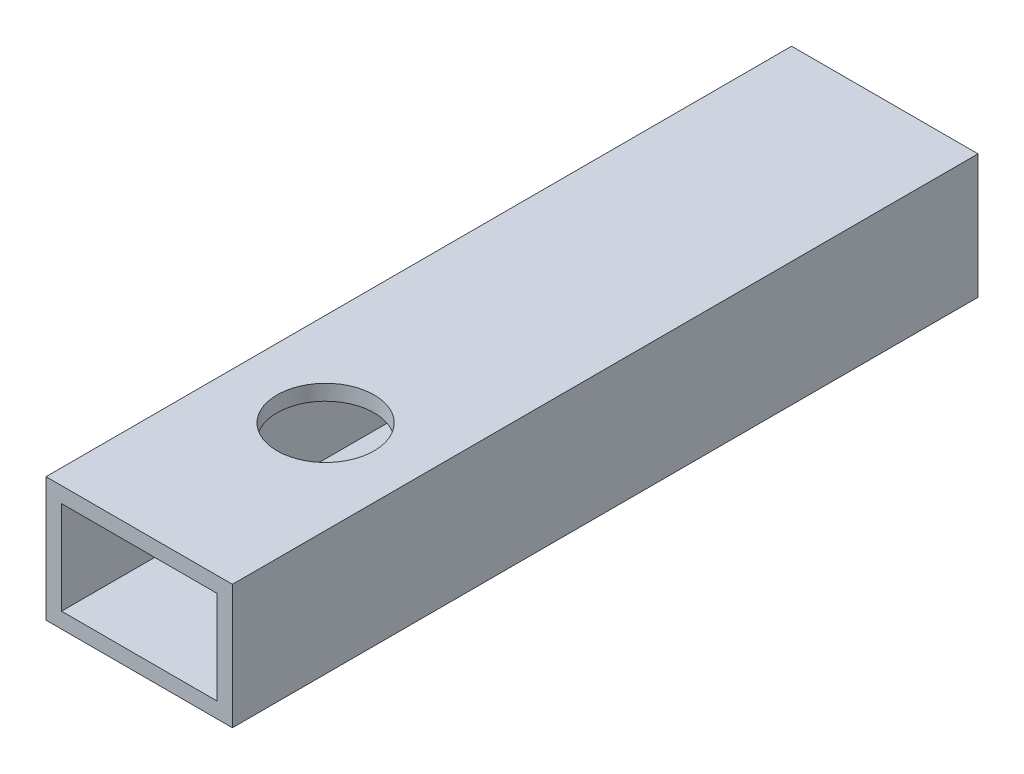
ISO-10303-21;
HEADER;
FILE_DESCRIPTION(('STEP AP214'),'2;1');
FILE_NAME('part.step','',(''),(''),'','','');
FILE_SCHEMA(('AUTOMOTIVE_DESIGN { 1 0 10303 214 1 1 1 1 }'));
ENDSEC;
DATA;
#1=APPLICATION_CONTEXT('core data for automotive mechanical design processes');
#2=APPLICATION_PROTOCOL_DEFINITION('international standard','automotive_design',2000,#1);
#3=PRODUCT_CONTEXT('',#1,'mechanical');
#4=PRODUCT('Part','Part','',(#3));
#5=PRODUCT_RELATED_PRODUCT_CATEGORY('part','',(#4));
#6=PRODUCT_DEFINITION_FORMATION('','',#4);
#7=PRODUCT_DEFINITION_CONTEXT('part definition',#1,'design');
#8=PRODUCT_DEFINITION('design','',#6,#7);
#9=PRODUCT_DEFINITION_SHAPE('','',#8);
#10=(LENGTH_UNIT() NAMED_UNIT(*) SI_UNIT(.MILLI.,.METRE.));
#11=(NAMED_UNIT(*) PLANE_ANGLE_UNIT() SI_UNIT($,.RADIAN.));
#12=(NAMED_UNIT(*) SI_UNIT($,.STERADIAN.) SOLID_ANGLE_UNIT());
#13=UNCERTAINTY_MEASURE_WITH_UNIT(LENGTH_MEASURE(1.E-05),#10,'distance_accuracy_value','');
#14=(GEOMETRIC_REPRESENTATION_CONTEXT(3) GLOBAL_UNCERTAINTY_ASSIGNED_CONTEXT((#13)) GLOBAL_UNIT_ASSIGNED_CONTEXT((#10,
#11,#12)) REPRESENTATION_CONTEXT('',''));
#15=CARTESIAN_POINT('',(0.,0.,0.));
#16=DIRECTION('',(0.,0.,1.));
#17=DIRECTION('',(1.,0.,0.));
#18=AXIS2_PLACEMENT_3D('',#15,#16,#17);
#19=CARTESIAN_POINT('',(-38.1,-25.4,-304.8));
#20=DIRECTION('',(-1.,0.,0.));
#21=DIRECTION('',(0.,0.,1.));
#22=AXIS2_PLACEMENT_3D('',#19,#20,#21);
#23=PLANE('',#22);
#24=DIRECTION('',(0.,-1.,0.));
#25=VECTOR('',#24,1.);
#26=CARTESIAN_POINT('',(-38.1,-25.4,0.));
#27=LINE('',#26,#25);
#28=CARTESIAN_POINT('',(-38.1,25.4,0.));
#29=VERTEX_POINT('',#28);
#30=CARTESIAN_POINT('',(-38.1,-25.4,0.));
#31=VERTEX_POINT('',#30);
#32=EDGE_CURVE('E130',#29,#31,#27,.T.);
#33=ORIENTED_EDGE('',*,*,#32,.F.);
#34=DIRECTION('',(0.,0.,1.));
#35=VECTOR('',#34,1.);
#36=CARTESIAN_POINT('',(-38.1,25.4,-304.8));
#37=LINE('',#36,#35);
#38=CARTESIAN_POINT('',(-38.1,25.4,-304.8));
#39=VERTEX_POINT('',#38);
#40=EDGE_CURVE('E11',#39,#29,#37,.T.);
#41=ORIENTED_EDGE('',*,*,#40,.F.);
#42=DIRECTION('',(0.,-1.,0.));
#43=VECTOR('',#42,1.);
#44=CARTESIAN_POINT('',(-38.1,-25.4,-304.8));
#45=LINE('',#44,#43);
#46=CARTESIAN_POINT('',(-38.1,-25.4,-304.8));
#47=VERTEX_POINT('',#46);
#48=EDGE_CURVE('E144',#39,#47,#45,.T.);
#49=ORIENTED_EDGE('',*,*,#48,.T.);
#50=DIRECTION('',(0.,0.,1.));
#51=VECTOR('',#50,1.);
#52=CARTESIAN_POINT('',(-38.1,-25.4,-304.8));
#53=LINE('',#52,#51);
#54=EDGE_CURVE('E155',#47,#31,#53,.T.);
#55=ORIENTED_EDGE('',*,*,#54,.T.);
#56=EDGE_LOOP('',(#33,#41,#49,#55));
#57=FACE_BOUND('',#56,.T.);
#58=ADVANCED_FACE('F31',(#57),#23,.T.);
#59=CARTESIAN_POINT('',(-38.1,25.4,-304.8));
#60=DIRECTION('',(0.,1.,0.));
#61=DIRECTION('',(0.,0.,1.));
#62=AXIS2_PLACEMENT_3D('',#59,#60,#61);
#63=PLANE('',#62);
#64=CARTESIAN_POINT('',(0.,25.4,-76.2));
#65=DIRECTION('',(0.,1.,0.));
#66=DIRECTION('',(0.,0.,1.));
#67=AXIS2_PLACEMENT_3D('',#64,#65,#66);
#68=CIRCLE('',#67,19.8374);
#69=CARTESIAN_POINT('',(0.,25.4,-56.3626));
#70=VERTEX_POINT('',#69);
#71=EDGE_CURVE('E240',#70,#70,#68,.T.);
#72=ORIENTED_EDGE('',*,*,#71,.F.);
#73=EDGE_LOOP('',(#72));
#74=FACE_BOUND('',#73,.T.);
#75=DIRECTION('',(-1.,0.,0.));
#76=VECTOR('',#75,1.);
#77=CARTESIAN_POINT('',(-38.1,25.4,0.));
#78=LINE('',#77,#76);
#79=CARTESIAN_POINT('',(38.1,25.4,0.));
#80=VERTEX_POINT('',#79);
#81=EDGE_CURVE('E141',#80,#29,#78,.T.);
#82=ORIENTED_EDGE('',*,*,#81,.F.);
#83=DIRECTION('',(0.,0.,1.));
#84=VECTOR('',#83,1.);
#85=CARTESIAN_POINT('',(38.1,25.4,-304.8));
#86=LINE('',#85,#84);
#87=CARTESIAN_POINT('',(38.1,25.4,-304.8));
#88=VERTEX_POINT('',#87);
#89=EDGE_CURVE('E39',#88,#80,#86,.T.);
#90=ORIENTED_EDGE('',*,*,#89,.F.);
#91=DIRECTION('',(-1.,0.,0.));
#92=VECTOR('',#91,1.);
#93=CARTESIAN_POINT('',(-38.1,25.4,-304.8));
#94=LINE('',#93,#92);
#95=EDGE_CURVE('E153',#88,#39,#94,.T.);
#96=ORIENTED_EDGE('',*,*,#95,.T.);
#97=ORIENTED_EDGE('',*,*,#40,.T.);
#98=EDGE_LOOP('',(#82,#90,#96,#97));
#99=FACE_BOUND('',#98,.T.);
#100=ADVANCED_FACE('F169',(#74,#99),#63,.T.);
#101=CARTESIAN_POINT('',(38.1,-25.4,-304.8));
#102=DIRECTION('',(1.,0.,0.));
#103=DIRECTION('',(0.,0.,-1.));
#104=AXIS2_PLACEMENT_3D('',#101,#102,#103);
#105=PLANE('',#104);
#106=DIRECTION('',(0.,1.,0.));
#107=VECTOR('',#106,1.);
#108=CARTESIAN_POINT('',(38.1,-25.4,0.));
#109=LINE('',#108,#107);
#110=CARTESIAN_POINT('',(38.1,-25.4,0.));
#111=VERTEX_POINT('',#110);
#112=EDGE_CURVE('E138',#111,#80,#109,.T.);
#113=ORIENTED_EDGE('',*,*,#112,.F.);
#114=DIRECTION('',(0.,0.,1.));
#115=VECTOR('',#114,1.);
#116=CARTESIAN_POINT('',(38.1,-25.4,-304.8));
#117=LINE('',#116,#115);
#118=CARTESIAN_POINT('',(38.1,-25.4,-304.8));
#119=VERTEX_POINT('',#118);
#120=EDGE_CURVE('E158',#119,#111,#117,.T.);
#121=ORIENTED_EDGE('',*,*,#120,.F.);
#122=DIRECTION('',(0.,1.,0.));
#123=VECTOR('',#122,1.);
#124=CARTESIAN_POINT('',(38.1,-25.4,-304.8));
#125=LINE('',#124,#123);
#126=EDGE_CURVE('E150',#119,#88,#125,.T.);
#127=ORIENTED_EDGE('',*,*,#126,.T.);
#128=ORIENTED_EDGE('',*,*,#89,.T.);
#129=EDGE_LOOP('',(#113,#121,#127,#128));
#130=FACE_BOUND('',#129,.T.);
#131=ADVANCED_FACE('F175',(#130),#105,.T.);
#132=CARTESIAN_POINT('',(-38.1,-25.4,-304.8));
#133=DIRECTION('',(0.,-1.,0.));
#134=DIRECTION('',(0.,0.,-1.));
#135=AXIS2_PLACEMENT_3D('',#132,#133,#134);
#136=PLANE('',#135);
#137=DIRECTION('',(1.,0.,0.));
#138=VECTOR('',#137,1.);
#139=CARTESIAN_POINT('',(-38.1,-25.4,0.));
#140=LINE('',#139,#138);
#141=EDGE_CURVE('E135',#31,#111,#140,.T.);
#142=ORIENTED_EDGE('',*,*,#141,.F.);
#143=ORIENTED_EDGE('',*,*,#54,.F.);
#144=DIRECTION('',(1.,0.,0.));
#145=VECTOR('',#144,1.);
#146=CARTESIAN_POINT('',(-38.1,-25.4,-304.8));
#147=LINE('',#146,#145);
#148=EDGE_CURVE('E147',#47,#119,#147,.T.);
#149=ORIENTED_EDGE('',*,*,#148,.T.);
#150=ORIENTED_EDGE('',*,*,#120,.T.);
#151=EDGE_LOOP('',(#142,#143,#149,#150));
#152=FACE_BOUND('',#151,.T.);
#153=ADVANCED_FACE('F165',(#152),#136,.T.);
#154=CARTESIAN_POINT('',(-38.1,25.4,-304.8));
#155=DIRECTION('',(0.,0.,-1.));
#156=DIRECTION('',(-1.,0.,0.));
#157=AXIS2_PLACEMENT_3D('',#154,#155,#156);
#158=PLANE('',#157);
#159=DIRECTION('',(1.,0.,0.));
#160=VECTOR('',#159,1.);
#161=CARTESIAN_POINT('',(-31.75,-19.05,-304.8));
#162=LINE('',#161,#160);
#163=CARTESIAN_POINT('',(-31.75,-19.05,-304.8));
#164=VERTEX_POINT('',#163);
#165=CARTESIAN_POINT('',(31.75,-19.05,-304.8));
#166=VERTEX_POINT('',#165);
#167=EDGE_CURVE('E116',#164,#166,#162,.T.);
#168=ORIENTED_EDGE('',*,*,#167,.T.);
#169=DIRECTION('',(0.,1.,0.));
#170=VECTOR('',#169,1.);
#171=CARTESIAN_POINT('',(31.75,-19.05,-304.8));
#172=LINE('',#171,#170);
#173=CARTESIAN_POINT('',(31.75,19.05,-304.8));
#174=VERTEX_POINT('',#173);
#175=EDGE_CURVE('E122',#166,#174,#172,.T.);
#176=ORIENTED_EDGE('',*,*,#175,.T.);
#177=DIRECTION('',(-1.,0.,0.));
#178=VECTOR('',#177,1.);
#179=CARTESIAN_POINT('',(-31.75,19.05,-304.8));
#180=LINE('',#179,#178);
#181=CARTESIAN_POINT('',(-31.75,19.05,-304.8));
#182=VERTEX_POINT('',#181);
#183=EDGE_CURVE('E47',#174,#182,#180,.T.);
#184=ORIENTED_EDGE('',*,*,#183,.T.);
#185=DIRECTION('',(0.,-1.,0.));
#186=VECTOR('',#185,1.);
#187=CARTESIAN_POINT('',(-31.75,-19.05,-304.8));
#188=LINE('',#187,#186);
#189=EDGE_CURVE('E125',#182,#164,#188,.T.);
#190=ORIENTED_EDGE('',*,*,#189,.T.);
#191=EDGE_LOOP('',(#168,#176,#184,#190));
#192=FACE_BOUND('',#191,.T.);
#193=ORIENTED_EDGE('',*,*,#48,.F.);
#194=ORIENTED_EDGE('',*,*,#95,.F.);
#195=ORIENTED_EDGE('',*,*,#126,.F.);
#196=ORIENTED_EDGE('',*,*,#148,.F.);
#197=EDGE_LOOP('',(#193,#194,#195,#196));
#198=FACE_BOUND('',#197,.T.);
#199=ADVANCED_FACE('F172',(#192,#198),#158,.T.);
#200=CARTESIAN_POINT('',(-38.1,25.4,0.));
#201=DIRECTION('',(0.,0.,-1.));
#202=DIRECTION('',(-1.,0.,0.));
#203=AXIS2_PLACEMENT_3D('',#200,#201,#202);
#204=PLANE('',#203);
#205=DIRECTION('',(0.,1.,0.));
#206=VECTOR('',#205,1.);
#207=CARTESIAN_POINT('',(31.75,-19.05,0.));
#208=LINE('',#207,#206);
#209=CARTESIAN_POINT('',(31.75,-19.05,0.));
#210=VERTEX_POINT('',#209);
#211=CARTESIAN_POINT('',(31.75,19.05,0.));
#212=VERTEX_POINT('',#211);
#213=EDGE_CURVE('E107',#210,#212,#208,.T.);
#214=ORIENTED_EDGE('',*,*,#213,.F.);
#215=DIRECTION('',(1.,0.,0.));
#216=VECTOR('',#215,1.);
#217=CARTESIAN_POINT('',(-31.75,-19.05,0.));
#218=LINE('',#217,#216);
#219=CARTESIAN_POINT('',(-31.75,-19.05,0.));
#220=VERTEX_POINT('',#219);
#221=EDGE_CURVE('E55',#220,#210,#218,.T.);
#222=ORIENTED_EDGE('',*,*,#221,.F.);
#223=DIRECTION('',(0.,-1.,0.));
#224=VECTOR('',#223,1.);
#225=CARTESIAN_POINT('',(-31.75,-19.05,0.));
#226=LINE('',#225,#224);
#227=CARTESIAN_POINT('',(-31.75,19.05,0.));
#228=VERTEX_POINT('',#227);
#229=EDGE_CURVE('E114',#228,#220,#226,.T.);
#230=ORIENTED_EDGE('',*,*,#229,.F.);
#231=DIRECTION('',(-1.,0.,0.));
#232=VECTOR('',#231,1.);
#233=CARTESIAN_POINT('',(-31.75,19.05,0.));
#234=LINE('',#233,#232);
#235=EDGE_CURVE('E98',#212,#228,#234,.T.);
#236=ORIENTED_EDGE('',*,*,#235,.F.);
#237=EDGE_LOOP('',(#214,#222,#230,#236));
#238=FACE_BOUND('',#237,.T.);
#239=ORIENTED_EDGE('',*,*,#32,.T.);
#240=ORIENTED_EDGE('',*,*,#141,.T.);
#241=ORIENTED_EDGE('',*,*,#112,.T.);
#242=ORIENTED_EDGE('',*,*,#81,.T.);
#243=EDGE_LOOP('',(#239,#240,#241,#242));
#244=FACE_BOUND('',#243,.T.);
#245=ADVANCED_FACE('F111',(#238,#244),#204,.F.);
#246=CARTESIAN_POINT('',(-31.75,-19.05,-304.8));
#247=DIRECTION('',(0.,-1.,0.));
#248=DIRECTION('',(0.,0.,-1.));
#249=AXIS2_PLACEMENT_3D('',#246,#247,#248);
#250=PLANE('',#249);
#251=ORIENTED_EDGE('',*,*,#221,.T.);
#252=DIRECTION('',(0.,0.,1.));
#253=VECTOR('',#252,1.);
#254=CARTESIAN_POINT('',(31.75,-19.05,-304.8));
#255=LINE('',#254,#253);
#256=EDGE_CURVE('E104',#166,#210,#255,.T.);
#257=ORIENTED_EDGE('',*,*,#256,.F.);
#258=ORIENTED_EDGE('',*,*,#167,.F.);
#259=DIRECTION('',(0.,0.,1.));
#260=VECTOR('',#259,1.);
#261=CARTESIAN_POINT('',(-31.75,-19.05,-304.8));
#262=LINE('',#261,#260);
#263=EDGE_CURVE('E128',#164,#220,#262,.T.);
#264=ORIENTED_EDGE('',*,*,#263,.T.);
#265=EDGE_LOOP('',(#251,#257,#258,#264));
#266=FACE_BOUND('',#265,.T.);
#267=ADVANCED_FACE('F227',(#266),#250,.F.);
#268=CARTESIAN_POINT('',(-31.75,-19.05,-304.8));
#269=DIRECTION('',(-1.,0.,0.));
#270=DIRECTION('',(0.,0.,1.));
#271=AXIS2_PLACEMENT_3D('',#268,#269,#270);
#272=PLANE('',#271);
#273=ORIENTED_EDGE('',*,*,#229,.T.);
#274=ORIENTED_EDGE('',*,*,#263,.F.);
#275=ORIENTED_EDGE('',*,*,#189,.F.);
#276=DIRECTION('',(0.,0.,1.));
#277=VECTOR('',#276,1.);
#278=CARTESIAN_POINT('',(-31.75,19.05,-304.8));
#279=LINE('',#278,#277);
#280=EDGE_CURVE('E103',#182,#228,#279,.T.);
#281=ORIENTED_EDGE('',*,*,#280,.T.);
#282=EDGE_LOOP('',(#273,#274,#275,#281));
#283=FACE_BOUND('',#282,.T.);
#284=ADVANCED_FACE('F206',(#283),#272,.F.);
#285=CARTESIAN_POINT('',(-31.75,19.05,-304.8));
#286=DIRECTION('',(0.,1.,0.));
#287=DIRECTION('',(0.,0.,1.));
#288=AXIS2_PLACEMENT_3D('',#285,#286,#287);
#289=PLANE('',#288);
#290=CARTESIAN_POINT('',(0.,19.05,-76.2));
#291=DIRECTION('',(0.,1.,0.));
#292=DIRECTION('',(0.,0.,1.));
#293=AXIS2_PLACEMENT_3D('',#290,#291,#292);
#294=CIRCLE('',#293,19.8374);
#295=CARTESIAN_POINT('',(0.,19.05,-56.3626));
#296=VERTEX_POINT('',#295);
#297=EDGE_CURVE('E34',#296,#296,#294,.T.);
#298=ORIENTED_EDGE('',*,*,#297,.T.);
#299=EDGE_LOOP('',(#298));
#300=FACE_BOUND('',#299,.T.);
#301=ORIENTED_EDGE('',*,*,#235,.T.);
#302=ORIENTED_EDGE('',*,*,#280,.F.);
#303=ORIENTED_EDGE('',*,*,#183,.F.);
#304=DIRECTION('',(0.,0.,1.));
#305=VECTOR('',#304,1.);
#306=CARTESIAN_POINT('',(31.75,19.05,-304.8));
#307=LINE('',#306,#305);
#308=EDGE_CURVE('E94',#174,#212,#307,.T.);
#309=ORIENTED_EDGE('',*,*,#308,.T.);
#310=EDGE_LOOP('',(#301,#302,#303,#309));
#311=FACE_BOUND('',#310,.T.);
#312=ADVANCED_FACE('F96',(#300,#311),#289,.F.);
#313=CARTESIAN_POINT('',(31.75,-19.05,-304.8));
#314=DIRECTION('',(1.,0.,0.));
#315=DIRECTION('',(0.,1.,0.));
#316=AXIS2_PLACEMENT_3D('',#313,#314,#315);
#317=PLANE('',#316);
#318=ORIENTED_EDGE('',*,*,#213,.T.);
#319=ORIENTED_EDGE('',*,*,#308,.F.);
#320=ORIENTED_EDGE('',*,*,#175,.F.);
#321=ORIENTED_EDGE('',*,*,#256,.T.);
#322=EDGE_LOOP('',(#318,#319,#320,#321));
#323=FACE_BOUND('',#322,.T.);
#324=ADVANCED_FACE('F108',(#323),#317,.F.);
#325=CARTESIAN_POINT('',(0.,12.7,-76.2));
#326=DIRECTION('',(0.,1.,0.));
#327=DIRECTION('',(0.,0.,1.));
#328=AXIS2_PLACEMENT_3D('',#325,#326,#327);
#329=CYLINDRICAL_SURFACE('',#328,19.8374);
#330=ORIENTED_EDGE('',*,*,#71,.T.);
#331=EDGE_LOOP('',(#330));
#332=FACE_BOUND('',#331,.T.);
#333=ORIENTED_EDGE('',*,*,#297,.F.);
#334=EDGE_LOOP('',(#333));
#335=FACE_BOUND('',#334,.T.);
#336=ADVANCED_FACE('F214',(#332,#335),#329,.F.);
#337=CLOSED_SHELL('',(#58,#100,#131,#153,#199,#245,#267,#284,#312,#324,#336));
#338=MANIFOLD_SOLID_BREP('B2',#337);
#339=ADVANCED_BREP_SHAPE_REPRESENTATION('',(#18,#338),#14);
#340=SHAPE_DEFINITION_REPRESENTATION(#9,#339);
ENDSEC;
END-ISO-10303-21;
